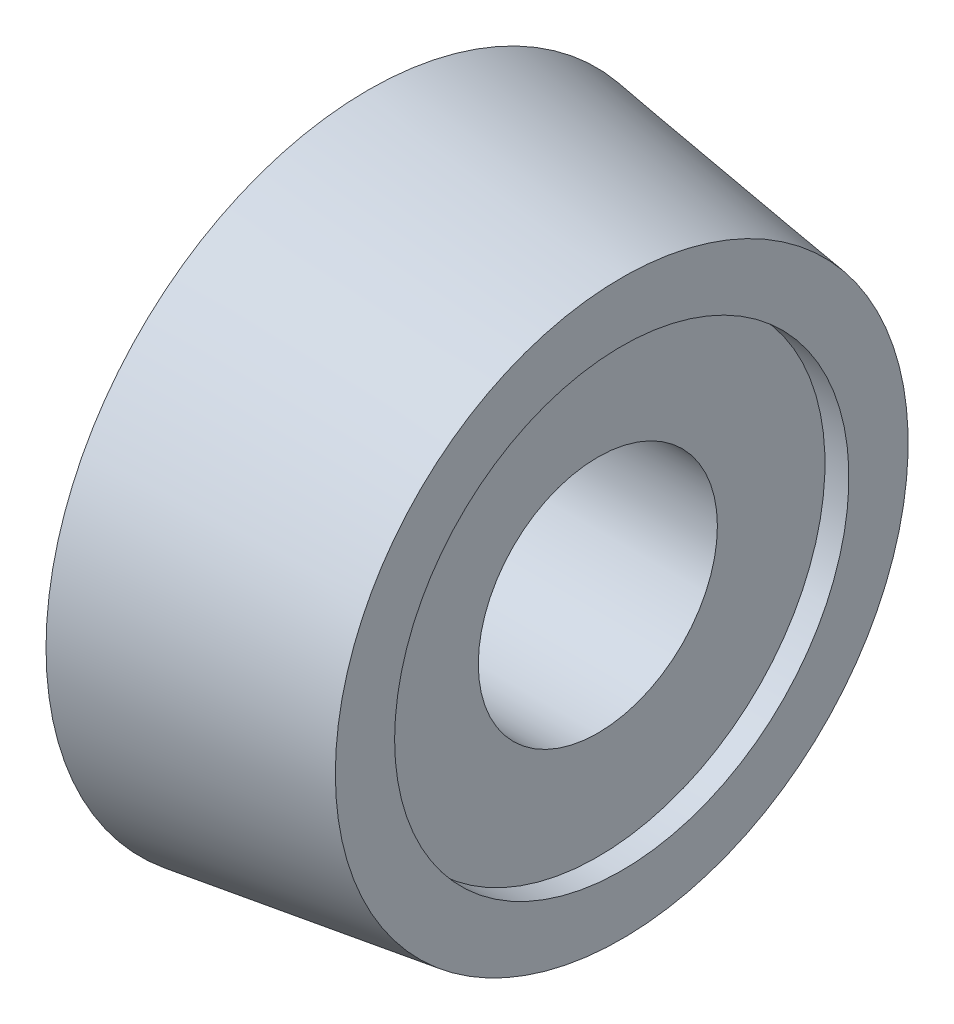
from build123d import *

# Parameters (mm, degrees)
SKICA2_R                 = 2.5
ODEBRAT_VYSUNUT_M1_DEPTH = 11.911946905
ODEBRAT_VYSUNUT_M2_DEPTH = 0.5


with BuildPart() as part:
    # Skica1 → Rotovat1 (revolve)
    with BuildSketch(Plane.XY, mode=Mode.PRIVATE) as rotovat1_sk:
        Polygon((-24.250127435, 2.5), (-24.250127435, 0.010705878), (-18.950127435, 0.010705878), (-18.950127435, 4.760705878), (-18.450127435, 4.760705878), (-18.450127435, 6), (-23.750127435, 6.75), (-23.750127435, 4.5), (-24.250127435, 4.5), align=None)
    revolve(rotovat1_sk.sketch.rotate(Axis((-24.250127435, 0.010705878, 0), (1, 0, 0)), 90), axis=Axis((-24.250127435, 0.010705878, 0), (1, 0, 0)))

    # Skica2 → Odebrat vysunut_m1 (cut, through all)
    with BuildSketch(Plane(origin=(-18.950127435, 0, 0), x_dir=(0, 0, -1), z_dir=(1, 0, 0))):
        Circle(SKICA2_R)
    extrude(amount=-ODEBRAT_VYSUNUT_M1_DEPTH, mode=Mode.SUBTRACT)

    # Skica3 → Odebrat vysunut_m2 (cut)
    with BuildSketch(Plane.ZY.offset(24.250127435)):
        Polygon((3.9, 40.056850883), (3.9, 2.234163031), (3.9, -2.212751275), (3.9, -40.035439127), (79.545375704, -40.035439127), (79.545375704, 40.056850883), align=None)
    extrude(amount=-ODEBRAT_VYSUNUT_M2_DEPTH, mode=Mode.SUBTRACT)


solid = part.part
